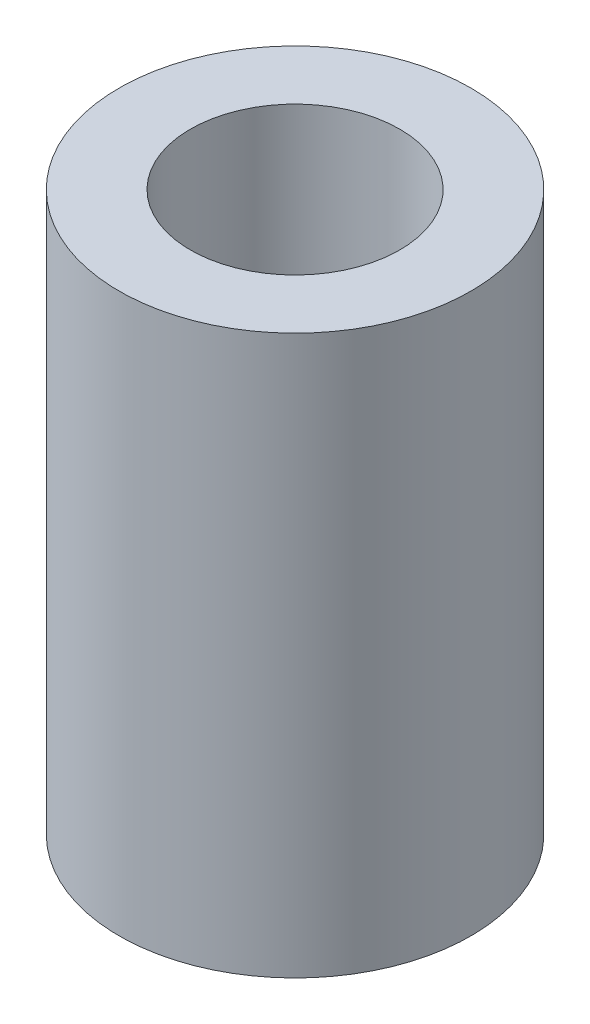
from build123d import *

# Parameters (mm, degrees)
SKETCH1_W = 1.61925
SKETCH1_H = 12.7


with BuildPart() as part:
    # Sketch1 → Revolve1 (revolve)
    with BuildSketch(Plane.XY, mode=Mode.PRIVATE) as revolve1_sk:
        with Locations((3.190875, 6.35)):
            Rectangle(SKETCH1_W, SKETCH1_H)
    revolve(revolve1_sk.sketch.rotate(Axis((0, 0, 0), (0, 1, 0)), 90), axis=Axis((0, 0, 0), (0, 1, 0)))


solid = part.part
